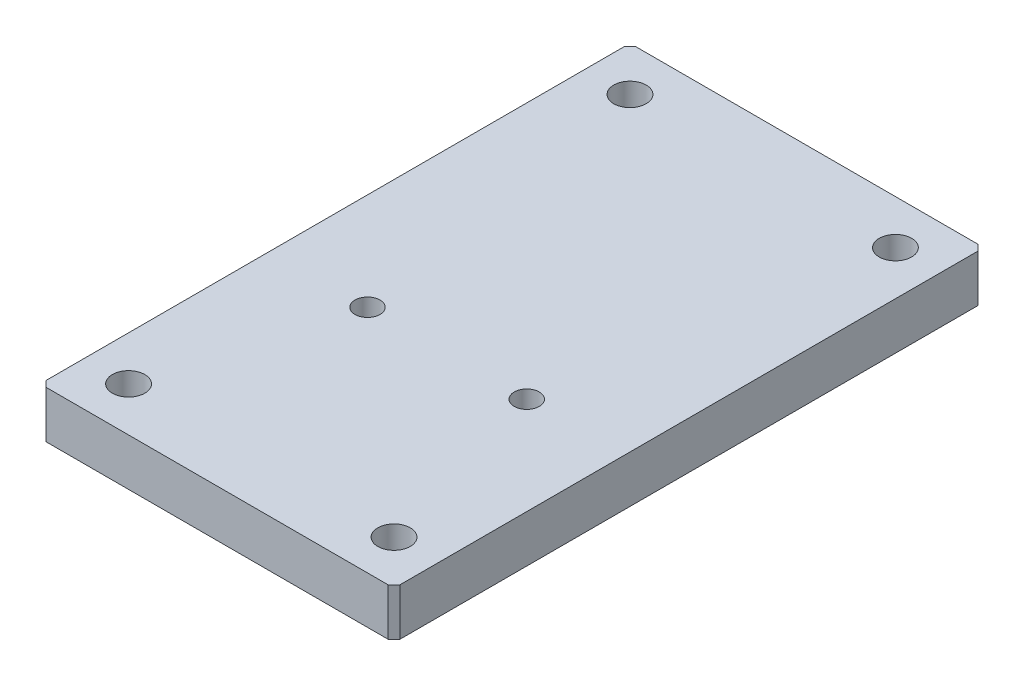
from build123d import *

# Parameters (mm, degrees)
SKETCH_1_W          = 120
SKETCH_1_H          = 200
EXTRUDE_1_DEPTH     = 16
M10X1_5_1_D         = 8.5
SKETCH_6_R          = 5.5
CUT_EXTRUDE_1_DEPTH = 210.418241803
CHAMFER_1_SIZE      = 2


with BuildPart() as part:
    # Sketch 1 → Extrude 1 (new body)
    with BuildSketch(Plane(origin=(0, 0, 0), x_dir=(1, 0, 0), z_dir=(0, 1, 0))):
        with Locations((0, 100)):
            Rectangle(SKETCH_1_W, SKETCH_1_H)
    extrude(amount=EXTRUDE_1_DEPTH)

    # M10x1.5 _1 (through all)
    with Locations(Plane(origin=(0, 16, 0), x_dir=(1, 0, 0), z_dir=(0, 1, 0))):
        with Locations((-27, 78), (27, 78)):
            Hole(M10X1_5_1_D / 2)

    # Sketch 6 → Cut-Extrude 1 (cut, through all)
    with BuildSketch(Plane(origin=(0, 16, 0), x_dir=(1, 0, 0), z_dir=(0, 1, 0))):
        with Locations(Location((-45, 185, 0), (0, 0, 270))):
            Circle(SKETCH_6_R)
        with Locations(Location((45, 185, 0), (0, 0, 270))):
            Circle(SKETCH_6_R)
        with Locations(Location((45, 15, 0), (0, 0, 270))):
            Circle(SKETCH_6_R)
        with Locations(Location((-45, 15, 0), (0, 0, 270))):
            Circle(SKETCH_6_R)
    extrude(amount=-CUT_EXTRUDE_1_DEPTH, mode=Mode.SUBTRACT)

    # Chamfer 1
    chamfer_1_edges = [part.edges().sort_by_distance(p)[0] for p in [
        (-60, 8, -200),
        (60, 8, -200),
        (60, 8, 0),
        (-60, 8, 0),
    ]]
    chamfer(chamfer_1_edges, length=CHAMFER_1_SIZE)


solid = part.part
